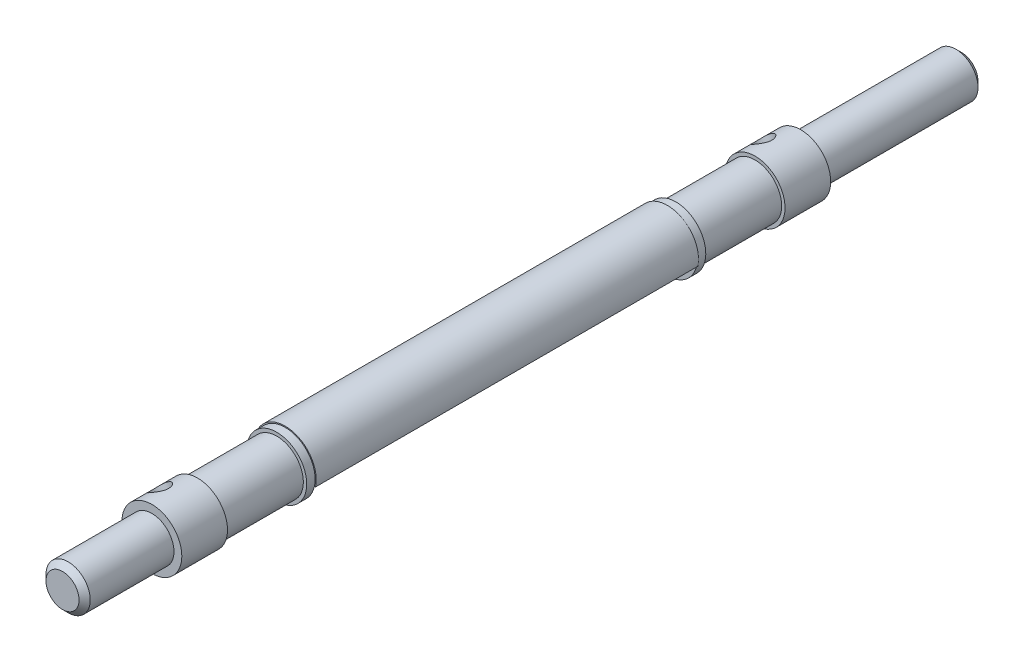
ISO-10303-21;
HEADER;
FILE_DESCRIPTION(('STEP AP214'),'2;1');
FILE_NAME('part.step','',(''),(''),'','','');
FILE_SCHEMA(('AUTOMOTIVE_DESIGN { 1 0 10303 214 1 1 1 1 }'));
ENDSEC;
DATA;
#1=APPLICATION_CONTEXT('core data for automotive mechanical design processes');
#2=APPLICATION_PROTOCOL_DEFINITION('international standard','automotive_design',2000,#1);
#3=PRODUCT_CONTEXT('',#1,'mechanical');
#4=PRODUCT('Part','Part','',(#3));
#5=PRODUCT_RELATED_PRODUCT_CATEGORY('part','',(#4));
#6=PRODUCT_DEFINITION_FORMATION('','',#4);
#7=PRODUCT_DEFINITION_CONTEXT('part definition',#1,'design');
#8=PRODUCT_DEFINITION('design','',#6,#7);
#9=PRODUCT_DEFINITION_SHAPE('','',#8);
#10=(LENGTH_UNIT() NAMED_UNIT(*) SI_UNIT(.MILLI.,.METRE.));
#11=(NAMED_UNIT(*) PLANE_ANGLE_UNIT() SI_UNIT($,.RADIAN.));
#12=(NAMED_UNIT(*) SI_UNIT($,.STERADIAN.) SOLID_ANGLE_UNIT());
#13=UNCERTAINTY_MEASURE_WITH_UNIT(LENGTH_MEASURE(1.E-05),#10,'distance_accuracy_value','');
#14=(GEOMETRIC_REPRESENTATION_CONTEXT(3) GLOBAL_UNCERTAINTY_ASSIGNED_CONTEXT((#13)) GLOBAL_UNIT_ASSIGNED_CONTEXT((#10,
#11,#12)) REPRESENTATION_CONTEXT('',''));
#15=CARTESIAN_POINT('',(0.,0.,0.));
#16=DIRECTION('',(0.,0.,1.));
#17=DIRECTION('',(1.,0.,0.));
#18=AXIS2_PLACEMENT_3D('',#15,#16,#17);
#19=CARTESIAN_POINT('',(-11.2332,-11.2332,81.));
#20=DIRECTION('',(0.,0.,1.));
#21=DIRECTION('',(1.,0.,0.));
#22=AXIS2_PLACEMENT_3D('',#19,#20,#21);
#23=PLANE('',#22);
#24=CARTESIAN_POINT('',(0.,0.,81.));
#25=DIRECTION('',(0.,0.,-1.));
#26=DIRECTION('',(-1.,0.,0.));
#27=AXIS2_PLACEMENT_3D('',#24,#25,#26);
#28=CIRCLE('',#27,11.1);
#29=CARTESIAN_POINT('',(10.8590975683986,-2.3,81.));
#30=VERTEX_POINT('',#29);
#31=CARTESIAN_POINT('',(-9.2,-6.2104750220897,81.));
#32=VERTEX_POINT('',#31);
#33=EDGE_CURVE('E282',#30,#32,#28,.F.);
#34=ORIENTED_EDGE('',*,*,#33,.T.);
#35=DIRECTION('',(0.,-1.,0.));
#36=VECTOR('',#35,1.);
#37=CARTESIAN_POINT('',(-9.2,-2.3,81.));
#38=LINE('',#37,#36);
#39=CARTESIAN_POINT('',(-9.2,-5.46351535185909,81.));
#40=VERTEX_POINT('',#39);
#41=EDGE_CURVE('E114',#40,#32,#38,.T.);
#42=ORIENTED_EDGE('',*,*,#41,.F.);
#43=CARTESIAN_POINT('',(0.,0.,81.));
#44=DIRECTION('',(0.,0.,1.));
#45=DIRECTION('',(1.,0.,0.));
#46=AXIS2_PLACEMENT_3D('',#43,#44,#45);
#47=CIRCLE('',#46,10.7);
#48=CARTESIAN_POINT('',(10.4498803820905,-2.3,81.));
#49=VERTEX_POINT('',#48);
#50=EDGE_CURVE('E279',#40,#49,#47,.F.);
#51=ORIENTED_EDGE('',*,*,#50,.T.);
#52=DIRECTION('',(-1.,0.,0.));
#53=VECTOR('',#52,1.);
#54=CARTESIAN_POINT('',(-9.2,-2.3,81.));
#55=LINE('',#54,#53);
#56=EDGE_CURVE('E104',#30,#49,#55,.T.);
#57=ORIENTED_EDGE('',*,*,#56,.F.);
#58=EDGE_LOOP('',(#34,#42,#51,#57));
#59=FACE_BOUND('',#58,.T.);
#60=ADVANCED_FACE('F38',(#59),#23,.T.);
#61=CARTESIAN_POINT('',(0.,0.,81.));
#62=DIRECTION('',(0.,0.,-1.));
#63=DIRECTION('',(-1.,0.,0.));
#64=AXIS2_PLACEMENT_3D('',#61,#62,#63);
#65=CYLINDRICAL_SURFACE('',#64,11.1);
#66=DIRECTION('',(0.,0.,-1.));
#67=VECTOR('',#66,1.);
#68=CARTESIAN_POINT('',(-9.2,-6.2104750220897,81.));
#69=LINE('',#68,#67);
#70=CARTESIAN_POINT('',(-9.2,-6.2104750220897,-55.5));
#71=VERTEX_POINT('',#70);
#72=EDGE_CURVE('E117',#32,#71,#69,.T.);
#73=ORIENTED_EDGE('',*,*,#72,.F.);
#74=ORIENTED_EDGE('',*,*,#33,.F.);
#75=DIRECTION('',(0.,0.,-1.));
#76=VECTOR('',#75,1.);
#77=CARTESIAN_POINT('',(10.8590975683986,-2.3,81.));
#78=LINE('',#77,#76);
#79=CARTESIAN_POINT('',(10.8590975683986,-2.3,-55.5));
#80=VERTEX_POINT('',#79);
#81=EDGE_CURVE('E103',#80,#30,#78,.F.);
#82=ORIENTED_EDGE('',*,*,#81,.F.);
#83=CARTESIAN_POINT('',(0.,0.,-55.5));
#84=DIRECTION('',(0.,0.,-1.));
#85=DIRECTION('',(-1.,0.,0.));
#86=AXIS2_PLACEMENT_3D('',#83,#84,#85);
#87=CIRCLE('',#86,11.1);
#88=EDGE_CURVE('E284',#71,#80,#87,.T.);
#89=ORIENTED_EDGE('',*,*,#88,.F.);
#90=EDGE_LOOP('',(#73,#74,#82,#89));
#91=FACE_BOUND('',#90,.T.);
#92=ADVANCED_FACE('F184',(#91),#65,.T.);
#93=CARTESIAN_POINT('',(11.2332,-11.2332,-55.5));
#94=DIRECTION('',(0.,0.,-1.));
#95=DIRECTION('',(-1.,0.,0.));
#96=AXIS2_PLACEMENT_3D('',#93,#94,#95);
#97=PLANE('',#96);
#98=CARTESIAN_POINT('',(0.,0.,-55.5));
#99=DIRECTION('',(0.,0.,-1.));
#100=DIRECTION('',(0.,1.,0.));
#101=AXIS2_PLACEMENT_3D('',#98,#99,#100);
#102=CIRCLE('',#101,10.7);
#103=CARTESIAN_POINT('',(10.4498803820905,-2.3,-55.5));
#104=VERTEX_POINT('',#103);
#105=CARTESIAN_POINT('',(-9.2,-5.46351535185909,-55.5));
#106=VERTEX_POINT('',#105);
#107=EDGE_CURVE('E287',#104,#106,#102,.F.);
#108=ORIENTED_EDGE('',*,*,#107,.T.);
#109=DIRECTION('',(0.,-1.,0.));
#110=VECTOR('',#109,1.);
#111=CARTESIAN_POINT('',(-9.2,-2.3,-55.5));
#112=LINE('',#111,#110);
#113=EDGE_CURVE('E108',#106,#71,#112,.T.);
#114=ORIENTED_EDGE('',*,*,#113,.T.);
#115=ORIENTED_EDGE('',*,*,#88,.T.);
#116=DIRECTION('',(-1.,0.,0.));
#117=VECTOR('',#116,1.);
#118=CARTESIAN_POINT('',(-9.2,-2.3,-55.5));
#119=LINE('',#118,#117);
#120=EDGE_CURVE('E93',#80,#104,#119,.T.);
#121=ORIENTED_EDGE('',*,*,#120,.T.);
#122=EDGE_LOOP('',(#108,#114,#115,#121));
#123=FACE_BOUND('',#122,.T.);
#124=ADVANCED_FACE('F190',(#123),#97,.T.);
#125=CARTESIAN_POINT('',(0.,0.,112.3));
#126=DIRECTION('',(0.,0.,1.));
#127=DIRECTION('',(1.,0.,0.));
#128=AXIS2_PLACEMENT_3D('',#125,#126,#127);
#129=CYLINDRICAL_SURFACE('',#128,10.7);
#130=CARTESIAN_POINT('',(-8.01720753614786,7.08621078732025,120.45000000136));
#131=CARTESIAN_POINT('',(-8.01720712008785,7.08621157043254,120.542779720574));
#132=CARTESIAN_POINT('',(-8.01455246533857,7.08921896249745,120.63556517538));
#133=CARTESIAN_POINT('',(-8.00395107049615,7.10118428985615,120.820458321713));
#134=CARTESIAN_POINT('',(-7.99600218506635,7.11014463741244,120.912565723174));
#135=CARTESIAN_POINT('',(-7.9642128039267,7.14579737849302,121.187084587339));
#136=CARTESIAN_POINT('',(-7.93242960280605,7.18126122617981,121.367577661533));
#137=CARTESIAN_POINT('',(-7.84832169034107,7.27307684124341,121.717510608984));
#138=CARTESIAN_POINT('',(-7.79604652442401,7.32937820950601,121.886976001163));
#139=CARTESIAN_POINT('',(-7.6716353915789,7.45949653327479,122.211208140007));
#140=CARTESIAN_POINT('',(-7.59950186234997,7.53331133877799,122.36597668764));
#141=CARTESIAN_POINT('',(-7.43351200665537,7.69720098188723,122.661963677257));
#142=CARTESIAN_POINT('',(-7.33902833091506,7.78772465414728,122.8025816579));
#143=CARTESIAN_POINT('',(-7.13080570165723,7.97881913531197,123.060920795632));
#144=CARTESIAN_POINT('',(-7.01706296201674,8.07939191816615,123.178637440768));
#145=CARTESIAN_POINT('',(-6.76897529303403,8.28841677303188,123.390474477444));
#146=CARTESIAN_POINT('',(-6.63420993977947,8.39699827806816,123.48397709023));
#147=CARTESIAN_POINT('',(-6.34862680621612,8.61493723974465,123.640659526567));
#148=CARTESIAN_POINT('',(-6.197813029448,8.72429449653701,123.703846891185));
#149=CARTESIAN_POINT('',(-5.88875860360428,8.93568351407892,123.796101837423));
#150=CARTESIAN_POINT('',(-5.73090736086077,9.03783765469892,123.826191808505));
#151=CARTESIAN_POINT('',(-5.40791009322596,9.23473046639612,123.854640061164));
#152=CARTESIAN_POINT('',(-5.242765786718,9.32947086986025,123.853005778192));
#153=CARTESIAN_POINT('',(-4.91623765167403,9.50546188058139,123.818718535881));
#154=CARTESIAN_POINT('',(-4.7549299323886,9.58707323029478,123.787174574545));
#155=CARTESIAN_POINT('',(-4.43512043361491,9.73915180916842,123.695786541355));
#156=CARTESIAN_POINT('',(-4.27661885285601,9.80961825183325,123.635940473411));
#157=CARTESIAN_POINT('',(-3.96526354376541,9.93959387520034,123.488948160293));
#158=CARTESIAN_POINT('',(-3.81250521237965,9.99895503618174,123.401469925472));
#159=CARTESIAN_POINT('',(-3.51938507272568,10.1058549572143,123.201972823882));
#160=CARTESIAN_POINT('',(-3.37902580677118,10.1533912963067,123.089948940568));
#161=CARTESIAN_POINT('',(-3.10936553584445,10.239274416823,122.838878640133));
#162=CARTESIAN_POINT('',(-2.98079638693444,10.2771399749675,122.698879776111));
#163=CARTESIAN_POINT('',(-2.74641347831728,10.3422457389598,122.398716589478));
#164=CARTESIAN_POINT('',(-2.64061058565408,10.3694808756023,122.23854269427));
#165=CARTESIAN_POINT('',(-2.45491343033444,10.4150238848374,121.899788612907));
#166=CARTESIAN_POINT('',(-2.3753628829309,10.4332147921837,121.721001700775));
#167=CARTESIAN_POINT('',(-2.27986345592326,10.4543412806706,121.444535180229));
#168=CARTESIAN_POINT('',(-2.2520085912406,10.460355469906,121.351042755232));
#169=CARTESIAN_POINT('',(-2.20452729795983,10.4704660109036,121.161901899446));
#170=CARTESIAN_POINT('',(-2.18489707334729,10.4745632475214,121.066254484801));
#171=CARTESIAN_POINT('',(-2.15580959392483,10.4805857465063,120.884006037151));
#172=CARTESIAN_POINT('',(-2.14548006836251,10.4826983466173,120.797548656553));
#173=CARTESIAN_POINT('',(-2.13169223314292,10.4855108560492,120.624062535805));
#174=CARTESIAN_POINT('',(-2.12823395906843,10.4862107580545,120.5370337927));
#175=CARTESIAN_POINT('',(-2.12823567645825,10.4862108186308,120.357220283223));
#176=CARTESIAN_POINT('',(-2.13216748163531,10.4854155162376,120.264434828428));
#177=CARTESIAN_POINT('',(-2.14783045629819,10.4822171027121,120.079541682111));
#178=CARTESIAN_POINT('',(-2.15956478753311,10.479813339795,119.987434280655));
#179=CARTESIAN_POINT('',(-2.20633565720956,10.4701092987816,119.712915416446));
#180=CARTESIAN_POINT('',(-2.252939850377,10.4603161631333,119.532422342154));
#181=CARTESIAN_POINT('',(-2.3745084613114,10.4333843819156,119.182489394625));
#182=CARTESIAN_POINT('',(-2.44940445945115,10.4162634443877,119.013024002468));
#183=CARTESIAN_POINT('',(-2.62429579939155,10.3735794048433,118.688791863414));
#184=CARTESIAN_POINT('',(-2.7242880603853,10.3480173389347,118.534023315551));
#185=CARTESIAN_POINT('',(-2.94921558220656,10.2862107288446,118.238036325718));
#186=CARTESIAN_POINT('',(-3.07485321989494,10.2496473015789,118.097418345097));
#187=CARTESIAN_POINT('',(-3.34445720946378,10.1648684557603,117.839079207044));
#188=CARTESIAN_POINT('',(-3.48842716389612,10.1166507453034,117.721362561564));
#189=CARTESIAN_POINT('',(-3.79349183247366,10.0063129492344,117.509525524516));
#190=CARTESIAN_POINT('',(-3.95490885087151,9.9438934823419,117.416022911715));
#191=CARTESIAN_POINT('',(-4.28644109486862,9.80554071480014,117.259340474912));
#192=CARTESIAN_POINT('',(-4.45655414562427,9.72961078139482,117.196153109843));
#193=CARTESIAN_POINT('',(-4.79414961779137,9.56765630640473,117.103898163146));
#194=CARTESIAN_POINT('',(-4.9615433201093,9.48203019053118,117.073808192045));
#195=CARTESIAN_POINT('',(-5.29355613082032,9.30075275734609,117.045359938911));
#196=CARTESIAN_POINT('',(-5.45817588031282,9.20510379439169,117.046994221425));
#197=CARTESIAN_POINT('',(-5.77385263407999,9.01031763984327,117.081281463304));
#198=CARTESIAN_POINT('',(-5.92518399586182,8.91142673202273,117.112825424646));
#199=CARTESIAN_POINT('',(-6.21679265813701,8.71050287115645,117.204213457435));
#200=CARTESIAN_POINT('',(-6.35706917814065,8.60846969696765,117.264059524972));
#201=CARTESIAN_POINT('',(-6.62530902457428,8.40381590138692,117.411051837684));
#202=CARTESIAN_POINT('',(-6.75309646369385,8.30120388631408,117.498530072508));
#203=CARTESIAN_POINT('',(-6.9922345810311,8.10080435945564,117.698027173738));
#204=CARTESIAN_POINT('',(-7.10358189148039,8.00301783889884,117.81005105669));
#205=CARTESIAN_POINT('',(-7.3127889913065,7.81242675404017,118.061121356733));
#206=CARTESIAN_POINT('',(-7.40986610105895,7.72001538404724,118.201120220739));
#207=CARTESIAN_POINT('',(-7.58344080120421,7.54958671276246,118.501283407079));
#208=CARTESIAN_POINT('',(-7.65992856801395,7.47157628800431,118.661457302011));
#209=CARTESIAN_POINT('',(-7.79221854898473,7.33352933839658,119.000211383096));
#210=CARTESIAN_POINT('',(-7.8477476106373,7.27373199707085,119.178998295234));
#211=CARTESIAN_POINT('',(-7.91379340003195,7.2015903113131,119.455464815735));
#212=CARTESIAN_POINT('',(-7.93292927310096,7.18047438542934,119.548957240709));
#213=CARTESIAN_POINT('',(-7.96542590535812,7.14440964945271,119.738098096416));
#214=CARTESIAN_POINT('',(-7.97878932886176,7.12945799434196,119.833745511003));
#215=CARTESIAN_POINT('',(-7.99854870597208,7.10727874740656,120.01599395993));
#216=CARTESIAN_POINT('',(-8.00554303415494,7.0993894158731,120.102451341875));
#217=CARTESIAN_POINT('',(-8.01487265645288,7.08885505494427,120.275937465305));
#218=CARTESIAN_POINT('',(-8.01720792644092,7.08621005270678,120.362966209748));
#219=CARTESIAN_POINT('',(-8.01720753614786,7.08621078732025,120.45000000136));
#220=B_SPLINE_CURVE_WITH_KNOTS('',3,(#130,#131,#132,#133,#134,#135,#136,#137,#138,#139,#140,
#141,#142,#143,#144,#145,#146,#147,#148,#149,#150,#151,#152,#153,#154,#155,#156,#157,#158,#159,
#160,#161,#162,#163,#164,#165,#166,#167,#168,#169,#170,#171,#172,#173,#174,#175,#176,#177,#178,
#179,#180,#181,#182,#183,#184,#185,#186,#187,#188,#189,#190,#191,#192,#193,#194,#195,#196,#197,
#198,#199,#200,#201,#202,#203,#204,#205,#206,#207,#208,#209,#210,#211,#212,#213,#214,#215,#216,
#217,#218,#219),.UNSPECIFIED.,.T.,.F.,(4,2,2,2,2,2,2,2,2,2,2,2,2,2,2,2,2,2,2,2,2,2,2,2,2,2,2,2,
2,2,2,2,2,2,2,2,2,2,2,2,2,2,2,2,4),(0.,0.27825205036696,0.556616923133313,1.11368727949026,
1.66941897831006,2.22508248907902,2.79872517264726,3.37248075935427,3.95968527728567,
4.54674364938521,5.11510863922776,5.68334041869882,6.23129456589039,6.77928736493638,
7.33413195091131,7.88909003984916,8.46783511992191,9.04685584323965,9.63318173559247,
9.92608014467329,10.2188432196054,10.4798615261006,10.7408811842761,11.0191332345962,
11.2974981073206,11.8545684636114,12.4103001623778,12.9659636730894,13.5396063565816,
14.1133619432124,14.7005664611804,15.2876248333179,15.8559898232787,16.4242216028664,
16.9721757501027,17.5201685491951,18.0750131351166,18.6299712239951,19.2087163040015,
19.7877370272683,20.3740629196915,20.6669613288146,20.9597244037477,21.220742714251,
21.4817623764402),.UNSPECIFIED.);
#221=CARTESIAN_POINT('',(-8.01720753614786,7.08621078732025,120.45000000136));
#222=VERTEX_POINT('',#221);
#223=EDGE_CURVE('E135',#222,#222,#220,.T.);
#224=ORIENTED_EDGE('',*,*,#223,.F.);
#225=EDGE_LOOP('',(#224));
#226=FACE_BOUND('',#225,.T.);
#227=CARTESIAN_POINT('',(0.,0.,112.3));
#228=DIRECTION('',(0.,0.,1.));
#229=DIRECTION('',(1.,0.,0.));
#230=AXIS2_PLACEMENT_3D('',#227,#228,#229);
#231=CIRCLE('',#230,10.7);
#232=CARTESIAN_POINT('',(10.7,0.,112.3));
#233=VERTEX_POINT('',#232);
#234=EDGE_CURVE('E246',#233,#233,#231,.T.);
#235=ORIENTED_EDGE('',*,*,#234,.T.);
#236=EDGE_LOOP('',(#235));
#237=FACE_BOUND('',#236,.T.);
#238=CARTESIAN_POINT('',(0.,0.,128.6));
#239=DIRECTION('',(0.,0.,1.));
#240=DIRECTION('',(1.,0.,0.));
#241=AXIS2_PLACEMENT_3D('',#238,#239,#240);
#242=CIRCLE('',#241,10.7);
#243=CARTESIAN_POINT('',(10.7,0.,128.6));
#244=VERTEX_POINT('',#243);
#245=EDGE_CURVE('E122',#244,#244,#242,.T.);
#246=ORIENTED_EDGE('',*,*,#245,.F.);
#247=EDGE_LOOP('',(#246));
#248=FACE_BOUND('',#247,.T.);
#249=ADVANCED_FACE('F200',(#226,#237,#248),#129,.T.);
#250=CARTESIAN_POINT('',(0.,0.,-86.8));
#251=DIRECTION('',(0.,0.,-1.));
#252=DIRECTION('',(0.,1.,0.));
#253=AXIS2_PLACEMENT_3D('',#250,#251,#252);
#254=CYLINDRICAL_SURFACE('',#253,10.7);
#255=CARTESIAN_POINT('',(-2.12823479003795,10.4862107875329,-94.9500000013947));
#256=CARTESIAN_POINT('',(-2.12823567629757,10.4862108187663,-95.0427797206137));
#257=CARTESIAN_POINT('',(-2.13216748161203,10.4854155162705,-95.1355651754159));
#258=CARTESIAN_POINT('',(-2.14783045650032,10.4822171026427,-95.3204583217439));
#259=CARTESIAN_POINT('',(-2.15956478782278,10.4798133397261,-95.4125657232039));
#260=CARTESIAN_POINT('',(-2.20633565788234,10.4701092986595,-95.6870845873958));
#261=CARTESIAN_POINT('',(-2.25293985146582,10.4603161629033,-95.867577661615));
#262=CARTESIAN_POINT('',(-2.37450846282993,10.4333843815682,-96.2175106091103));
#263=CARTESIAN_POINT('',(-2.44940446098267,10.416263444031,-96.3869760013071));
#264=CARTESIAN_POINT('',(-2.62429580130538,10.3735794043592,-96.7112081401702));
#265=CARTESIAN_POINT('',(-2.72428806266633,10.3480173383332,-96.8659766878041));
#266=CARTESIAN_POINT('',(-2.94921558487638,10.286210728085,-97.1619636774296));
#267=CARTESIAN_POINT('',(-3.07485322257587,10.2496473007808,-97.3025816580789));
#268=CARTESIAN_POINT('',(-3.34445721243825,10.1648684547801,-97.5609207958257));
#269=CARTESIAN_POINT('',(-3.48842716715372,10.1166507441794,-97.6786374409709));
#270=CARTESIAN_POINT('',(-3.79349183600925,10.0063129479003,-97.89047447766));
#271=CARTESIAN_POINT('',(-3.95490885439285,9.94389348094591,-97.9839770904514));
#272=CARTESIAN_POINT('',(-4.28644109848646,9.805540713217,-98.1406595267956));
#273=CARTESIAN_POINT('',(-4.4565541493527,9.7296107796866,-98.2038468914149));
#274=CARTESIAN_POINT('',(-4.79414962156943,9.56765630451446,-98.2961018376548));
#275=CARTESIAN_POINT('',(-4.96154332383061,9.48203018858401,-98.3261918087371));
#276=CARTESIAN_POINT('',(-5.29355613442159,9.30075275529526,-98.3546400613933));
#277=CARTESIAN_POINT('',(-5.45817588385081,9.20510379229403,-98.3530057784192));
#278=CARTESIAN_POINT('',(-5.77385263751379,9.010317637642,-98.3187185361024));
#279=CARTESIAN_POINT('',(-5.92518399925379,8.9114267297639,-98.2871745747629));
#280=CARTESIAN_POINT('',(-6.21679266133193,8.71050286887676,-98.195786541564));
#281=CARTESIAN_POINT('',(-6.3570691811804,8.60846969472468,-98.1359404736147));
#282=CARTESIAN_POINT('',(-6.62530902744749,8.40381589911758,-97.9889481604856));
#283=CARTESIAN_POINT('',(-6.75309646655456,8.30120388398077,-97.9014699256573));
#284=CARTESIAN_POINT('',(-6.99223458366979,8.10080435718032,-97.7019728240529));
#285=CARTESIAN_POINT('',(-7.10358189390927,8.0030178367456,-97.5899489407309));
#286=CARTESIAN_POINT('',(-7.31278899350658,7.81242675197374,-97.3388786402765));
#287=CARTESIAN_POINT('',(-7.40986610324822,7.72001538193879,-97.198879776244));
#288=CARTESIAN_POINT('',(-7.58344080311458,7.54958671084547,-96.8987165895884));
#289=CARTESIAN_POINT('',(-7.65992856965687,7.47157628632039,-96.7385426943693));
#290=CARTESIAN_POINT('',(-7.79221855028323,7.33352933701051,-96.3997886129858));
#291=CARTESIAN_POINT('',(-7.8477476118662,7.27373199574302,-96.2210017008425));
#292=CARTESIAN_POINT('',(-7.91379340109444,7.20159031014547,-95.9445351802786));
#293=CARTESIAN_POINT('',(-7.93292927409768,7.1804743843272,-95.8510427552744));
#294=CARTESIAN_POINT('',(-7.96542590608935,7.14440964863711,-95.6619018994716));
#295=CARTESIAN_POINT('',(-7.97878932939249,7.12945799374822,-95.5662544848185));
#296=CARTESIAN_POINT('',(-7.99854870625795,7.10727874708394,-95.3840060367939));
#297=CARTESIAN_POINT('',(-8.0055430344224,7.0993894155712,-95.2975486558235));
#298=CARTESIAN_POINT('',(-8.01487265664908,7.08885505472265,-95.1240625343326));
#299=CARTESIAN_POINT('',(-8.01720792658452,7.08621005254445,-95.0370337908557));
#300=CARTESIAN_POINT('',(-8.01720712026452,7.08621157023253,-94.8572202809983));
#301=CARTESIAN_POINT('',(-8.0145524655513,7.08921896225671,-94.7644348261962));
#302=CARTESIAN_POINT('',(-8.00395107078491,7.10118428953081,-94.5795416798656));
#303=CARTESIAN_POINT('',(-7.99600218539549,7.11014463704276,-94.4874342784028));
#304=CARTESIAN_POINT('',(-7.96421280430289,7.14579737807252,-94.2129154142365));
#305=CARTESIAN_POINT('',(-7.93242960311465,7.18126122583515,-94.032422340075));
#306=CARTESIAN_POINT('',(-7.84832169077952,7.27307684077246,-93.6824893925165));
#307=CARTESIAN_POINT('',(-7.79604652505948,7.32937820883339,-93.5130240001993));
#308=CARTESIAN_POINT('',(-7.67163539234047,7.45949653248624,-93.1887918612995));
#309=CARTESIAN_POINT('',(-7.59950186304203,7.53331133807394,-93.0340233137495));
#310=CARTESIAN_POINT('',(-7.43351200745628,7.69720098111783,-92.7380363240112));
#311=CARTESIAN_POINT('',(-7.33902833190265,7.7877246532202,-92.597418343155));
#312=CARTESIAN_POINT('',(-7.13080570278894,7.97881913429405,-92.339079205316));
#313=CARTESIAN_POINT('',(-7.01706296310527,8.07939191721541,-92.2213625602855));
#314=CARTESIAN_POINT('',(-6.76897529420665,8.28841677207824,-92.0095255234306));
#315=CARTESIAN_POINT('',(-6.63420994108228,8.39699827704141,-91.9160229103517));
#316=CARTESIAN_POINT('',(-6.34862680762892,8.61493723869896,-91.7593404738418));
#317=CARTESIAN_POINT('',(-6.19781303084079,8.72429449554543,-91.6961531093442));
#318=CARTESIAN_POINT('',(-5.88875860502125,8.93568351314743,-91.6038981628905));
#319=CARTESIAN_POINT('',(-5.73090736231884,9.03783765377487,-91.573808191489));
#320=CARTESIAN_POINT('',(-5.40791009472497,9.23473046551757,-91.545359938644));
#321=CARTESIAN_POINT('',(-5.24276578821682,9.32947086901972,-91.5469942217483));
#322=CARTESIAN_POINT('',(-4.91623765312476,9.50546187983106,-91.5812814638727));
#323=CARTESIAN_POINT('',(-4.7549299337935,9.58707322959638,-91.6128254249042));
#324=CARTESIAN_POINT('',(-4.43512043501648,9.73915180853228,-91.7042134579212));
#325=CARTESIAN_POINT('',(-4.27661885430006,9.80961825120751,-91.7640595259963));
#326=CARTESIAN_POINT('',(-3.96526354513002,9.93959387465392,-91.9110518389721));
#327=CARTESIAN_POINT('',(-3.81250521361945,9.99895503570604,-91.9985300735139));
#328=CARTESIAN_POINT('',(-3.51938507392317,10.1058549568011,-92.1980271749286));
#329=CARTESIAN_POINT('',(-3.37902580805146,10.1533912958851,-92.3100510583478));
#330=CARTESIAN_POINT('',(-3.1093655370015,10.2392744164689,-92.5611213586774));
#331=CARTESIAN_POINT('',(-2.98079638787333,10.2771399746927,-92.701120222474));
#332=CARTESIAN_POINT('',(-2.74641347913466,10.3422457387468,-93.0012834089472));
#333=CARTESIAN_POINT('',(-2.64061058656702,10.3694808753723,-93.1614573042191));
#334=CARTESIAN_POINT('',(-2.4549134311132,10.4150238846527,-93.5002113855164));
#335=CARTESIAN_POINT('',(-2.37536288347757,10.4332147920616,-93.6789982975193));
#336=CARTESIAN_POINT('',(-2.27986345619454,10.4543412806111,-93.9554648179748));
#337=CARTESIAN_POINT('',(-2.25200859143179,10.4603554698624,-94.0489572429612));
#338=CARTESIAN_POINT('',(-2.2045272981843,10.4704660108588,-94.2380980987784));
#339=CARTESIAN_POINT('',(-2.18489707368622,10.4745632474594,-94.3337455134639));
#340=CARTESIAN_POINT('',(-2.1558095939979,10.4805857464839,-94.5159939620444));
#341=CARTESIAN_POINT('',(-2.14548006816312,10.4826983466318,-94.602451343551));
#342=CARTESIAN_POINT('',(-2.13169223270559,10.4855108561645,-94.7759374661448));
#343=CARTESIAN_POINT('',(-2.12823395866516,10.4862107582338,-94.8629662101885));
#344=CARTESIAN_POINT('',(-2.12823479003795,10.4862107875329,-94.9500000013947));
#345=B_SPLINE_CURVE_WITH_KNOTS('',3,(#255,#256,#257,#258,#259,#260,#261,#262,#263,#264,#265,
#266,#267,#268,#269,#270,#271,#272,#273,#274,#275,#276,#277,#278,#279,#280,#281,#282,#283,#284,
#285,#286,#287,#288,#289,#290,#291,#292,#293,#294,#295,#296,#297,#298,#299,#300,#301,#302,#303,
#304,#305,#306,#307,#308,#309,#310,#311,#312,#313,#314,#315,#316,#317,#318,#319,#320,#321,#322,
#323,#324,#325,#326,#327,#328,#329,#330,#331,#332,#333,#334,#335,#336,#337,#338,#339,#340,#341,
#342,#343,#344),.UNSPECIFIED.,.T.,.F.,(4,2,2,2,2,2,2,2,2,2,2,2,2,2,2,2,2,2,2,2,2,2,2,2,2,2,2,2,
2,2,2,2,2,2,2,2,2,2,2,2,2,2,2,2,4),(0.,0.278252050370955,0.556616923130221,1.11368727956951,
1.66941897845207,2.22508248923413,2.79872517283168,3.37248075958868,3.95968527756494,
4.54674364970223,5.11510863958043,5.68334041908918,6.23129456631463,6.77928736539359,
7.33413195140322,7.88909004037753,8.46783512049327,9.04685584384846,9.63318173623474,
9.9260801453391,10.2188432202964,10.4798615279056,10.7408811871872,11.0191332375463,
11.2974981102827,11.854568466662,12.4103001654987,12.9659636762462,13.5396063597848,
14.1133619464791,14.7005664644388,15.2876248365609,15.8559898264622,16.4242216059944,
16.9721757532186,17.5201685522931,18.0750131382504,18.6299712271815,19.2087163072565,
19.7877370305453,20.3740629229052,20.6669613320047,20.9597244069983,21.2207427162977,
21.4817623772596),.UNSPECIFIED.);
#346=CARTESIAN_POINT('',(-2.12823479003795,10.4862107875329,-94.9500000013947));
#347=VERTEX_POINT('',#346);
#348=EDGE_CURVE('E130',#347,#347,#345,.T.);
#349=ORIENTED_EDGE('',*,*,#348,.F.);
#350=EDGE_LOOP('',(#349));
#351=FACE_BOUND('',#350,.T.);
#352=CARTESIAN_POINT('',(0.,0.,-86.8));
#353=DIRECTION('',(0.,0.,-1.));
#354=DIRECTION('',(0.,1.,0.));
#355=AXIS2_PLACEMENT_3D('',#352,#353,#354);
#356=CIRCLE('',#355,10.7);
#357=CARTESIAN_POINT('',(0.,10.7,-86.8));
#358=VERTEX_POINT('',#357);
#359=EDGE_CURVE('E131',#358,#358,#356,.F.);
#360=ORIENTED_EDGE('',*,*,#359,.F.);
#361=EDGE_LOOP('',(#360));
#362=FACE_BOUND('',#361,.T.);
#363=CARTESIAN_POINT('',(0.,0.,-103.1));
#364=DIRECTION('',(0.,0.,-1.));
#365=DIRECTION('',(-1.,0.,0.));
#366=AXIS2_PLACEMENT_3D('',#363,#364,#365);
#367=CIRCLE('',#366,10.7);
#368=CARTESIAN_POINT('',(-10.7,0.,-103.1));
#369=VERTEX_POINT('',#368);
#370=EDGE_CURVE('E126',#369,#369,#367,.T.);
#371=ORIENTED_EDGE('',*,*,#370,.F.);
#372=EDGE_LOOP('',(#371));
#373=FACE_BOUND('',#372,.T.);
#374=ADVANCED_FACE('F144',(#351,#362,#373),#254,.T.);
#375=CARTESIAN_POINT('',(0.971463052,-1.682623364,120.45));
#376=DIRECTION('',(-0.500000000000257,0.86602540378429,0.));
#377=DIRECTION('',(-0.86602540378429,-0.500000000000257,0.));
#378=AXIS2_PLACEMENT_3D('',#375,#376,#377);
#379=CONICAL_SURFACE('',#378,0.,1.02974425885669);
#380=CARTESIAN_POINT('',(0.97146305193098,-1.6826233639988,120.45));
#381=VERTEX_POINT('',#380);
#382=VERTEX_LOOP('',#381);
#383=FACE_BOUND('',#382,.T.);
#384=CARTESIAN_POINT('',(-0.0499999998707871,0.0866025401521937,120.45));
#385=DIRECTION('',(-0.50000000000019,0.866025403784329,0.));
#386=DIRECTION('',(-0.866025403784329,-0.500000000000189,0.));
#387=AXIS2_PLACEMENT_3D('',#384,#385,#386);
#388=CIRCLE('',#387,3.4000000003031);
#389=CARTESIAN_POINT('',(-2.994486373,-1.61339746,120.45));
#390=VERTEX_POINT('',#389);
#391=EDGE_CURVE('E132',#390,#390,#388,.F.);
#392=ORIENTED_EDGE('',*,*,#391,.F.);
#393=EDGE_LOOP('',(#392));
#394=FACE_BOUND('',#393,.T.);
#395=ADVANCED_FACE('F158',(#383,#394),#379,.F.);
#396=CARTESIAN_POINT('',(-0.0499999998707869,0.086602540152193,120.45));
#397=DIRECTION('',(-0.500000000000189,0.866025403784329,0.));
#398=DIRECTION('',(-0.866025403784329,-0.500000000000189,0.));
#399=AXIS2_PLACEMENT_3D('',#396,#397,#398);
#400=CYLINDRICAL_SURFACE('',#399,3.40000000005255);
#401=ORIENTED_EDGE('',*,*,#391,.T.);
#402=EDGE_LOOP('',(#401));
#403=FACE_BOUND('',#402,.T.);
#404=ORIENTED_EDGE('',*,*,#223,.T.);
#405=EDGE_LOOP('',(#404));
#406=FACE_BOUND('',#405,.T.);
#407=ADVANCED_FACE('F250',(#403,#406),#400,.F.);
#408=CARTESIAN_POINT('',(-10.8284,-10.8284,112.3));
#409=DIRECTION('',(0.,0.,1.));
#410=DIRECTION('',(1.,0.,0.));
#411=AXIS2_PLACEMENT_3D('',#408,#409,#410);
#412=PLANE('',#411);
#413=CARTESIAN_POINT('',(0.,0.,112.3));
#414=DIRECTION('',(0.,0.,1.));
#415=DIRECTION('',(1.,0.,0.));
#416=AXIS2_PLACEMENT_3D('',#413,#414,#415);
#417=CIRCLE('',#416,9.5);
#418=CARTESIAN_POINT('',(9.5,0.,112.3));
#419=VERTEX_POINT('',#418);
#420=EDGE_CURVE('E268',#419,#419,#417,.T.);
#421=ORIENTED_EDGE('',*,*,#420,.T.);
#422=EDGE_LOOP('',(#421));
#423=FACE_BOUND('',#422,.T.);
#424=ORIENTED_EDGE('',*,*,#234,.F.);
#425=EDGE_LOOP('',(#424));
#426=FACE_BOUND('',#425,.T.);
#427=ADVANCED_FACE('F254',(#423,#426),#412,.F.);
#428=CARTESIAN_POINT('',(0.,0.,84.));
#429=DIRECTION('',(0.,0.,1.));
#430=DIRECTION('',(1.,0.,0.));
#431=AXIS2_PLACEMENT_3D('',#428,#429,#430);
#432=CYLINDRICAL_SURFACE('',#431,9.5);
#433=CARTESIAN_POINT('',(0.,0.,84.));
#434=DIRECTION('',(0.,0.,1.));
#435=DIRECTION('',(1.,0.,0.));
#436=AXIS2_PLACEMENT_3D('',#433,#434,#435);
#437=CIRCLE('',#436,9.5);
#438=CARTESIAN_POINT('',(9.5,0.,84.));
#439=VERTEX_POINT('',#438);
#440=EDGE_CURVE('E272',#439,#439,#437,.F.);
#441=ORIENTED_EDGE('',*,*,#440,.F.);
#442=EDGE_LOOP('',(#441));
#443=FACE_BOUND('',#442,.T.);
#444=ORIENTED_EDGE('',*,*,#420,.F.);
#445=EDGE_LOOP('',(#444));
#446=FACE_BOUND('',#445,.T.);
#447=ADVANCED_FACE('F259',(#443,#446),#432,.T.);
#448=CARTESIAN_POINT('',(-10.8284,-10.8284,84.));
#449=DIRECTION('',(0.,0.,1.));
#450=DIRECTION('',(1.,0.,0.));
#451=AXIS2_PLACEMENT_3D('',#448,#449,#450);
#452=PLANE('',#451);
#453=ORIENTED_EDGE('',*,*,#440,.T.);
#454=EDGE_LOOP('',(#453));
#455=FACE_BOUND('',#454,.T.);
#456=CARTESIAN_POINT('',(0.,0.,84.));
#457=DIRECTION('',(0.,0.,1.));
#458=DIRECTION('',(1.,0.,0.));
#459=AXIS2_PLACEMENT_3D('',#456,#457,#458);
#460=CIRCLE('',#459,10.7);
#461=CARTESIAN_POINT('',(10.7,0.,84.));
#462=VERTEX_POINT('',#461);
#463=EDGE_CURVE('E274',#462,#462,#460,.T.);
#464=ORIENTED_EDGE('',*,*,#463,.T.);
#465=EDGE_LOOP('',(#464));
#466=FACE_BOUND('',#465,.T.);
#467=ADVANCED_FACE('F196',(#455,#466),#452,.T.);
#468=CARTESIAN_POINT('',(0.,0.,81.));
#469=DIRECTION('',(0.,0.,1.));
#470=DIRECTION('',(1.,0.,0.));
#471=AXIS2_PLACEMENT_3D('',#468,#469,#470);
#472=CYLINDRICAL_SURFACE('',#471,10.7);
#473=EDGE_CURVE('E280',#49,#40,#47,.F.);
#474=ORIENTED_EDGE('',*,*,#473,.F.);
#475=ORIENTED_EDGE('',*,*,#50,.F.);
#476=EDGE_LOOP('',(#474,#475));
#477=FACE_BOUND('',#476,.T.);
#478=ORIENTED_EDGE('',*,*,#463,.F.);
#479=EDGE_LOOP('',(#478));
#480=FACE_BOUND('',#479,.T.);
#481=ADVANCED_FACE('F322',(#477,#480),#472,.T.);
#482=CARTESIAN_POINT('',(0.,0.,-55.5));
#483=DIRECTION('',(0.,0.,-1.));
#484=DIRECTION('',(0.,1.,0.));
#485=AXIS2_PLACEMENT_3D('',#482,#483,#484);
#486=CYLINDRICAL_SURFACE('',#485,10.7);
#487=EDGE_CURVE('E90',#106,#104,#102,.F.);
#488=ORIENTED_EDGE('',*,*,#487,.F.);
#489=ORIENTED_EDGE('',*,*,#107,.F.);
#490=EDGE_LOOP('',(#488,#489));
#491=FACE_BOUND('',#490,.T.);
#492=CARTESIAN_POINT('',(0.,0.,-58.5));
#493=DIRECTION('',(0.,0.,-1.));
#494=DIRECTION('',(0.,1.,0.));
#495=AXIS2_PLACEMENT_3D('',#492,#493,#494);
#496=CIRCLE('',#495,10.7);
#497=CARTESIAN_POINT('',(0.,10.7,-58.5));
#498=VERTEX_POINT('',#497);
#499=EDGE_CURVE('E289',#498,#498,#496,.T.);
#500=ORIENTED_EDGE('',*,*,#499,.F.);
#501=EDGE_LOOP('',(#500));
#502=FACE_BOUND('',#501,.T.);
#503=ADVANCED_FACE('F206',(#491,#502),#486,.T.);
#504=CARTESIAN_POINT('',(10.8284,-10.8284,-58.5));
#505=DIRECTION('',(0.,0.,-1.));
#506=DIRECTION('',(-1.,0.,0.));
#507=AXIS2_PLACEMENT_3D('',#504,#505,#506);
#508=PLANE('',#507);
#509=CARTESIAN_POINT('',(0.,0.,-58.5));
#510=DIRECTION('',(0.,0.,-1.));
#511=DIRECTION('',(0.,1.,0.));
#512=AXIS2_PLACEMENT_3D('',#509,#510,#511);
#513=CIRCLE('',#512,9.5);
#514=CARTESIAN_POINT('',(0.,9.5,-58.5));
#515=VERTEX_POINT('',#514);
#516=EDGE_CURVE('E292',#515,#515,#513,.F.);
#517=ORIENTED_EDGE('',*,*,#516,.T.);
#518=EDGE_LOOP('',(#517));
#519=FACE_BOUND('',#518,.T.);
#520=ORIENTED_EDGE('',*,*,#499,.T.);
#521=EDGE_LOOP('',(#520));
#522=FACE_BOUND('',#521,.T.);
#523=ADVANCED_FACE('F202',(#519,#522),#508,.T.);
#524=CARTESIAN_POINT('',(0.,0.,-58.5));
#525=DIRECTION('',(0.,0.,-1.));
#526=DIRECTION('',(0.,1.,0.));
#527=AXIS2_PLACEMENT_3D('',#524,#525,#526);
#528=CYLINDRICAL_SURFACE('',#527,9.5);
#529=CARTESIAN_POINT('',(0.,0.,-86.8));
#530=DIRECTION('',(0.,0.,-1.));
#531=DIRECTION('',(0.,1.,0.));
#532=AXIS2_PLACEMENT_3D('',#529,#530,#531);
#533=CIRCLE('',#532,9.5);
#534=CARTESIAN_POINT('',(0.,9.50000000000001,-86.8));
#535=VERTEX_POINT('',#534);
#536=EDGE_CURVE('E294',#535,#535,#533,.F.);
#537=ORIENTED_EDGE('',*,*,#536,.T.);
#538=EDGE_LOOP('',(#537));
#539=FACE_BOUND('',#538,.T.);
#540=ORIENTED_EDGE('',*,*,#516,.F.);
#541=EDGE_LOOP('',(#540));
#542=FACE_BOUND('',#541,.T.);
#543=ADVANCED_FACE('F205',(#539,#542),#528,.T.);
#544=CARTESIAN_POINT('',(10.8284,-10.8284,-86.8));
#545=DIRECTION('',(0.,0.,-1.));
#546=DIRECTION('',(-1.,0.,0.));
#547=AXIS2_PLACEMENT_3D('',#544,#545,#546);
#548=PLANE('',#547);
#549=ORIENTED_EDGE('',*,*,#536,.F.);
#550=EDGE_LOOP('',(#549));
#551=FACE_BOUND('',#550,.T.);
#552=ORIENTED_EDGE('',*,*,#359,.T.);
#553=EDGE_LOOP('',(#552));
#554=FACE_BOUND('',#553,.T.);
#555=ADVANCED_FACE('F211',(#551,#554),#548,.F.);
#556=CARTESIAN_POINT('',(0.971463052,-1.682623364,-94.95));
#557=DIRECTION('',(-0.500000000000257,0.86602540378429,0.));
#558=DIRECTION('',(-0.86602540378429,-0.500000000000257,0.));
#559=AXIS2_PLACEMENT_3D('',#556,#557,#558);
#560=CONICAL_SURFACE('',#559,0.,1.02974425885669);
#561=CARTESIAN_POINT('',(0.97146305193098,-1.6826233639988,-94.95));
#562=VERTEX_POINT('',#561);
#563=VERTEX_LOOP('',#562);
#564=FACE_BOUND('',#563,.T.);
#565=CARTESIAN_POINT('',(-0.0499999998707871,0.0866025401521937,-94.95));
#566=DIRECTION('',(-0.50000000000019,0.866025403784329,0.));
#567=DIRECTION('',(-0.866025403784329,-0.500000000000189,0.));
#568=AXIS2_PLACEMENT_3D('',#565,#566,#567);
#569=CIRCLE('',#568,3.4000000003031);
#570=CARTESIAN_POINT('',(-2.994486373,-1.61339746,-94.95));
#571=VERTEX_POINT('',#570);
#572=EDGE_CURVE('E127',#571,#571,#569,.F.);
#573=ORIENTED_EDGE('',*,*,#572,.F.);
#574=EDGE_LOOP('',(#573));
#575=FACE_BOUND('',#574,.T.);
#576=ADVANCED_FACE('F152',(#564,#575),#560,.F.);
#577=CARTESIAN_POINT('',(-0.0499999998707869,0.086602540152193,-94.95));
#578=DIRECTION('',(-0.500000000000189,0.866025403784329,0.));
#579=DIRECTION('',(-0.866025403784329,-0.500000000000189,0.));
#580=AXIS2_PLACEMENT_3D('',#577,#578,#579);
#581=CYLINDRICAL_SURFACE('',#580,3.40000000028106);
#582=ORIENTED_EDGE('',*,*,#348,.T.);
#583=EDGE_LOOP('',(#582));
#584=FACE_BOUND('',#583,.T.);
#585=ORIENTED_EDGE('',*,*,#572,.T.);
#586=EDGE_LOOP('',(#585));
#587=FACE_BOUND('',#586,.T.);
#588=ADVANCED_FACE('F147',(#584,#587),#581,.F.);
#589=CARTESIAN_POINT('',(0.,0.,-103.1));
#590=DIRECTION('',(0.,0.,-1.));
#591=DIRECTION('',(-1.,0.,0.));
#592=AXIS2_PLACEMENT_3D('',#589,#590,#591);
#593=PLANE('',#592);
#594=CARTESIAN_POINT('',(0.,0.,-103.1));
#595=DIRECTION('',(0.,0.,-1.));
#596=DIRECTION('',(-1.,0.,0.));
#597=AXIS2_PLACEMENT_3D('',#594,#595,#596);
#598=CIRCLE('',#597,7.9);
#599=CARTESIAN_POINT('',(-7.9,0.,-103.1));
#600=VERTEX_POINT('',#599);
#601=EDGE_CURVE('E123',#600,#600,#598,.T.);
#602=ORIENTED_EDGE('',*,*,#601,.F.);
#603=EDGE_LOOP('',(#602));
#604=FACE_BOUND('',#603,.T.);
#605=ORIENTED_EDGE('',*,*,#370,.T.);
#606=EDGE_LOOP('',(#605));
#607=FACE_BOUND('',#606,.T.);
#608=ADVANCED_FACE('F151',(#604,#607),#593,.T.);
#609=CARTESIAN_POINT('',(0.,0.,-103.1));
#610=DIRECTION('',(0.,0.,-1.));
#611=DIRECTION('',(-1.,0.,0.));
#612=AXIS2_PLACEMENT_3D('',#609,#610,#611);
#613=CYLINDRICAL_SURFACE('',#612,7.9);
#614=CARTESIAN_POINT('',(0.,0.,-158.5));
#615=DIRECTION('',(0.,0.,1.));
#616=DIRECTION('',(1.,0.,0.));
#617=AXIS2_PLACEMENT_3D('',#614,#615,#616);
#618=CIRCLE('',#617,7.9);
#619=CARTESIAN_POINT('',(7.9,0.,-158.5));
#620=VERTEX_POINT('',#619);
#621=EDGE_CURVE('E227',#620,#620,#618,.T.);
#622=ORIENTED_EDGE('',*,*,#621,.T.);
#623=EDGE_LOOP('',(#622));
#624=FACE_BOUND('',#623,.T.);
#625=ORIENTED_EDGE('',*,*,#601,.T.);
#626=EDGE_LOOP('',(#625));
#627=FACE_BOUND('',#626,.T.);
#628=ADVANCED_FACE('F156',(#624,#627),#613,.T.);
#629=CARTESIAN_POINT('',(-10.8284,-10.8284,-160.5));
#630=DIRECTION('',(0.,0.,1.));
#631=DIRECTION('',(1.,0.,0.));
#632=AXIS2_PLACEMENT_3D('',#629,#630,#631);
#633=PLANE('',#632);
#634=CARTESIAN_POINT('',(0.,0.,-160.5));
#635=DIRECTION('',(0.,0.,1.));
#636=DIRECTION('',(1.,0.,0.));
#637=AXIS2_PLACEMENT_3D('',#634,#635,#636);
#638=CIRCLE('',#637,5.89999999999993);
#639=CARTESIAN_POINT('',(5.89999999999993,0.,-160.5));
#640=VERTEX_POINT('',#639);
#641=EDGE_CURVE('E142',#640,#640,#638,.F.);
#642=ORIENTED_EDGE('',*,*,#641,.T.);
#643=EDGE_LOOP('',(#642));
#644=FACE_BOUND('',#643,.T.);
#645=ADVANCED_FACE('F161',(#644),#633,.F.);
#646=CARTESIAN_POINT('',(0.,0.,128.6));
#647=DIRECTION('',(0.,0.,1.));
#648=DIRECTION('',(1.,0.,0.));
#649=AXIS2_PLACEMENT_3D('',#646,#647,#648);
#650=PLANE('',#649);
#651=CARTESIAN_POINT('',(0.,0.,128.6));
#652=DIRECTION('',(0.,0.,1.));
#653=DIRECTION('',(1.,0.,0.));
#654=AXIS2_PLACEMENT_3D('',#651,#652,#653);
#655=CIRCLE('',#654,7.9);
#656=CARTESIAN_POINT('',(7.9,0.,128.6));
#657=VERTEX_POINT('',#656);
#658=EDGE_CURVE('E119',#657,#657,#655,.T.);
#659=ORIENTED_EDGE('',*,*,#658,.F.);
#660=EDGE_LOOP('',(#659));
#661=FACE_BOUND('',#660,.T.);
#662=ORIENTED_EDGE('',*,*,#245,.T.);
#663=EDGE_LOOP('',(#662));
#664=FACE_BOUND('',#663,.T.);
#665=ADVANCED_FACE('F163',(#661,#664),#650,.T.);
#666=CARTESIAN_POINT('',(0.,0.,128.6));
#667=DIRECTION('',(0.,0.,1.));
#668=DIRECTION('',(1.,0.,0.));
#669=AXIS2_PLACEMENT_3D('',#666,#667,#668);
#670=CYLINDRICAL_SURFACE('',#669,7.9);
#671=CARTESIAN_POINT('',(0.,0.,158.5));
#672=DIRECTION('',(0.,0.,1.));
#673=DIRECTION('',(1.,0.,0.));
#674=AXIS2_PLACEMENT_3D('',#671,#672,#673);
#675=CIRCLE('',#674,7.9);
#676=CARTESIAN_POINT('',(7.9,0.,158.5));
#677=VERTEX_POINT('',#676);
#678=EDGE_CURVE('E12',#677,#677,#675,.F.);
#679=ORIENTED_EDGE('',*,*,#678,.T.);
#680=EDGE_LOOP('',(#679));
#681=FACE_BOUND('',#680,.T.);
#682=ORIENTED_EDGE('',*,*,#658,.T.);
#683=EDGE_LOOP('',(#682));
#684=FACE_BOUND('',#683,.T.);
#685=ADVANCED_FACE('F166',(#681,#684),#670,.T.);
#686=CARTESIAN_POINT('',(-10.8284,-10.8284,160.5));
#687=DIRECTION('',(0.,0.,1.));
#688=DIRECTION('',(1.,0.,0.));
#689=AXIS2_PLACEMENT_3D('',#686,#687,#688);
#690=PLANE('',#689);
#691=CARTESIAN_POINT('',(0.,0.,160.5));
#692=DIRECTION('',(0.,0.,1.));
#693=DIRECTION('',(1.,0.,0.));
#694=AXIS2_PLACEMENT_3D('',#691,#692,#693);
#695=CIRCLE('',#694,5.89999999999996);
#696=CARTESIAN_POINT('',(5.89999999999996,0.,160.5));
#697=VERTEX_POINT('',#696);
#698=EDGE_CURVE('E46',#697,#697,#695,.T.);
#699=ORIENTED_EDGE('',*,*,#698,.T.);
#700=EDGE_LOOP('',(#699));
#701=FACE_BOUND('',#700,.T.);
#702=ADVANCED_FACE('F170',(#701),#690,.T.);
#703=CARTESIAN_POINT('',(0.,0.,-160.5));
#704=DIRECTION('',(0.,0.,1.));
#705=DIRECTION('',(1.,0.,0.));
#706=AXIS2_PLACEMENT_3D('',#703,#704,#705);
#707=CONICAL_SURFACE('',#706,5.89999999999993,0.785398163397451);
#708=ORIENTED_EDGE('',*,*,#621,.F.);
#709=EDGE_LOOP('',(#708));
#710=FACE_BOUND('',#709,.T.);
#711=ORIENTED_EDGE('',*,*,#641,.F.);
#712=EDGE_LOOP('',(#711));
#713=FACE_BOUND('',#712,.T.);
#714=ADVANCED_FACE('F214',(#710,#713),#707,.T.);
#715=CARTESIAN_POINT('',(0.,0.,160.5));
#716=DIRECTION('',(0.,0.,-1.));
#717=DIRECTION('',(-1.,0.,0.));
#718=AXIS2_PLACEMENT_3D('',#715,#716,#717);
#719=CONICAL_SURFACE('',#718,5.89999999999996,0.785398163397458);
#720=ORIENTED_EDGE('',*,*,#678,.F.);
#721=EDGE_LOOP('',(#720));
#722=FACE_BOUND('',#721,.T.);
#723=ORIENTED_EDGE('',*,*,#698,.F.);
#724=EDGE_LOOP('',(#723));
#725=FACE_BOUND('',#724,.T.);
#726=ADVANCED_FACE('F40',(#722,#725),#719,.T.);
#727=CARTESIAN_POINT('',(0.,0.,81.));
#728=DIRECTION('',(0.,0.,1.));
#729=DIRECTION('',(1.,0.,0.));
#730=AXIS2_PLACEMENT_3D('',#727,#728,#729);
#731=PLANE('',#730);
#732=CARTESIAN_POINT('',(-9.2,-2.3,81.));
#733=VERTEX_POINT('',#732);
#734=EDGE_CURVE('E112',#733,#40,#38,.T.);
#735=ORIENTED_EDGE('',*,*,#734,.F.);
#736=EDGE_CURVE('E99',#49,#733,#55,.T.);
#737=ORIENTED_EDGE('',*,*,#736,.F.);
#738=ORIENTED_EDGE('',*,*,#473,.T.);
#739=EDGE_LOOP('',(#735,#737,#738));
#740=FACE_BOUND('',#739,.T.);
#741=ADVANCED_FACE('F174',(#740),#731,.F.);
#742=CARTESIAN_POINT('',(-9.2,-2.3,81.));
#743=DIRECTION('',(1.,0.,0.));
#744=DIRECTION('',(0.,1.,0.));
#745=AXIS2_PLACEMENT_3D('',#742,#743,#744);
#746=PLANE('',#745);
#747=ORIENTED_EDGE('',*,*,#72,.T.);
#748=ORIENTED_EDGE('',*,*,#113,.F.);
#749=CARTESIAN_POINT('',(-9.2,-2.3,-55.5));
#750=VERTEX_POINT('',#749);
#751=EDGE_CURVE('E53',#750,#106,#112,.T.);
#752=ORIENTED_EDGE('',*,*,#751,.F.);
#753=DIRECTION('',(0.,0.,-1.));
#754=VECTOR('',#753,1.);
#755=CARTESIAN_POINT('',(-9.2,-2.3,81.));
#756=LINE('',#755,#754);
#757=EDGE_CURVE('E96',#733,#750,#756,.T.);
#758=ORIENTED_EDGE('',*,*,#757,.F.);
#759=ORIENTED_EDGE('',*,*,#734,.T.);
#760=ORIENTED_EDGE('',*,*,#41,.T.);
#761=EDGE_LOOP('',(#747,#748,#752,#758,#759,#760));
#762=FACE_BOUND('',#761,.T.);
#763=ADVANCED_FACE('F106',(#762),#746,.T.);
#764=CARTESIAN_POINT('',(-9.2,-2.3,81.));
#765=DIRECTION('',(0.,-1.,0.));
#766=DIRECTION('',(0.,0.,-1.));
#767=AXIS2_PLACEMENT_3D('',#764,#765,#766);
#768=PLANE('',#767);
#769=ORIENTED_EDGE('',*,*,#81,.T.);
#770=ORIENTED_EDGE('',*,*,#56,.T.);
#771=ORIENTED_EDGE('',*,*,#736,.T.);
#772=ORIENTED_EDGE('',*,*,#757,.T.);
#773=EDGE_CURVE('E86',#104,#750,#119,.T.);
#774=ORIENTED_EDGE('',*,*,#773,.F.);
#775=ORIENTED_EDGE('',*,*,#120,.F.);
#776=EDGE_LOOP('',(#769,#770,#771,#772,#774,#775));
#777=FACE_BOUND('',#776,.T.);
#778=ADVANCED_FACE('F97',(#777),#768,.T.);
#779=CARTESIAN_POINT('',(0.,0.,-55.5));
#780=DIRECTION('',(0.,0.,1.));
#781=DIRECTION('',(1.,0.,0.));
#782=AXIS2_PLACEMENT_3D('',#779,#780,#781);
#783=PLANE('',#782);
#784=ORIENTED_EDGE('',*,*,#487,.T.);
#785=ORIENTED_EDGE('',*,*,#773,.T.);
#786=ORIENTED_EDGE('',*,*,#751,.T.);
#787=EDGE_LOOP('',(#784,#785,#786));
#788=FACE_BOUND('',#787,.T.);
#789=ADVANCED_FACE('F88',(#788),#783,.T.);
#790=CLOSED_SHELL('',(#60,#92,#124,#249,#374,#395,#407,#427,#447,#467,#481,#503,#523,#543,#555,
#576,#588,#608,#628,#645,#665,#685,#702,#714,#726,#741,#763,#778,#789));
#791=MANIFOLD_SOLID_BREP('B2',#790);
#792=ADVANCED_BREP_SHAPE_REPRESENTATION('',(#18,#791),#14);
#793=SHAPE_DEFINITION_REPRESENTATION(#9,#792);
ENDSEC;
END-ISO-10303-21;
